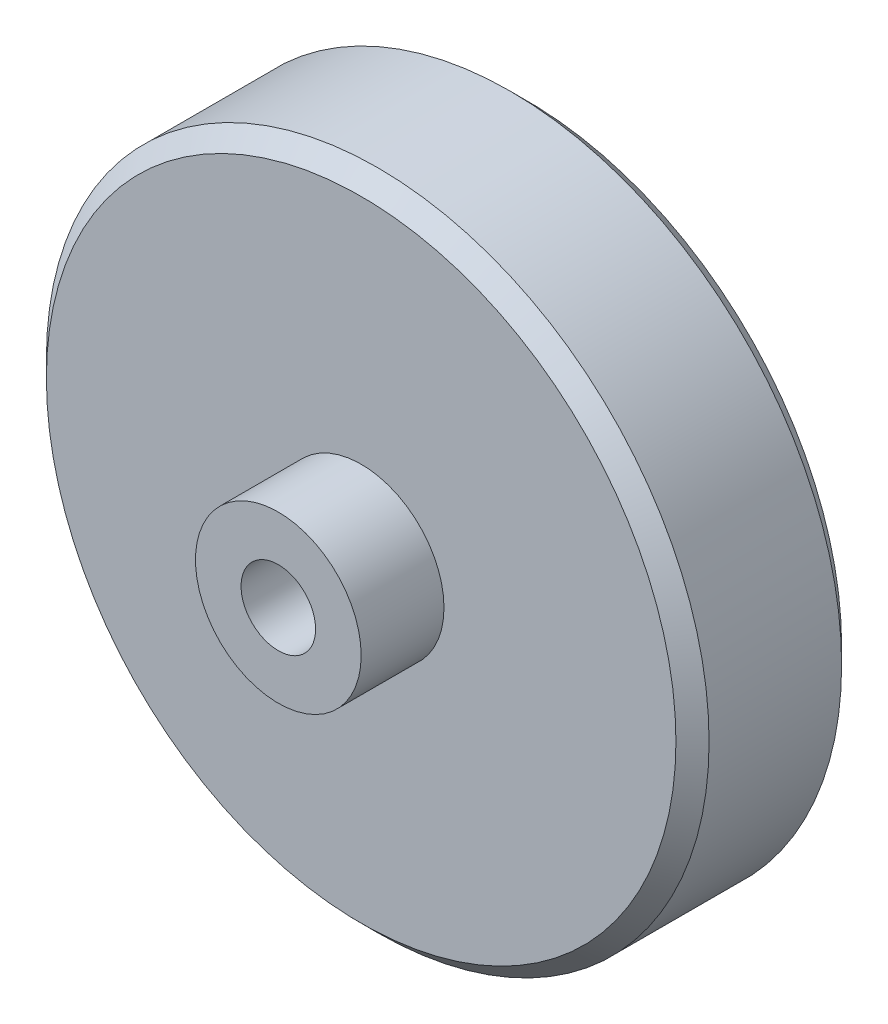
from build123d import *

# Parameters (mm, degrees)
SKETCH1_R      = 20
EXTRUDE1_DEPTH = 10
SKETCH2_R      = 5
EXTRUDE2_DEPTH = 5
SKETCH3_R      = 2.25
EXTRUDE3_DEPTH = 33.015621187
CHAMFER1_SIZE  = 1


with BuildPart() as part:
    # Sketch1 → Extrude1 (new body)
    with BuildSketch(Plane.XY):
        Circle(SKETCH1_R)
    extrude(amount=EXTRUDE1_DEPTH)

    # Sketch2 → Extrude2 (add)
    with BuildSketch(Plane.XY.offset(10)):
        Circle(SKETCH2_R)
    extrude(amount=EXTRUDE2_DEPTH)

    # Sketch3 → Extrude3 (cut, through all)
    with BuildSketch(Plane.XY.offset(15)):
        Circle(SKETCH3_R)
    extrude(amount=-EXTRUDE3_DEPTH, mode=Mode.SUBTRACT)

    # Chamfer1
    chamfer1_edges = [part.edges().sort_by_distance(p)[0] for p in [
        (-20, 0, 0),
        (-20, 0, 10),
    ]]
    chamfer(chamfer1_edges, length=CHAMFER1_SIZE)


solid = part.part
